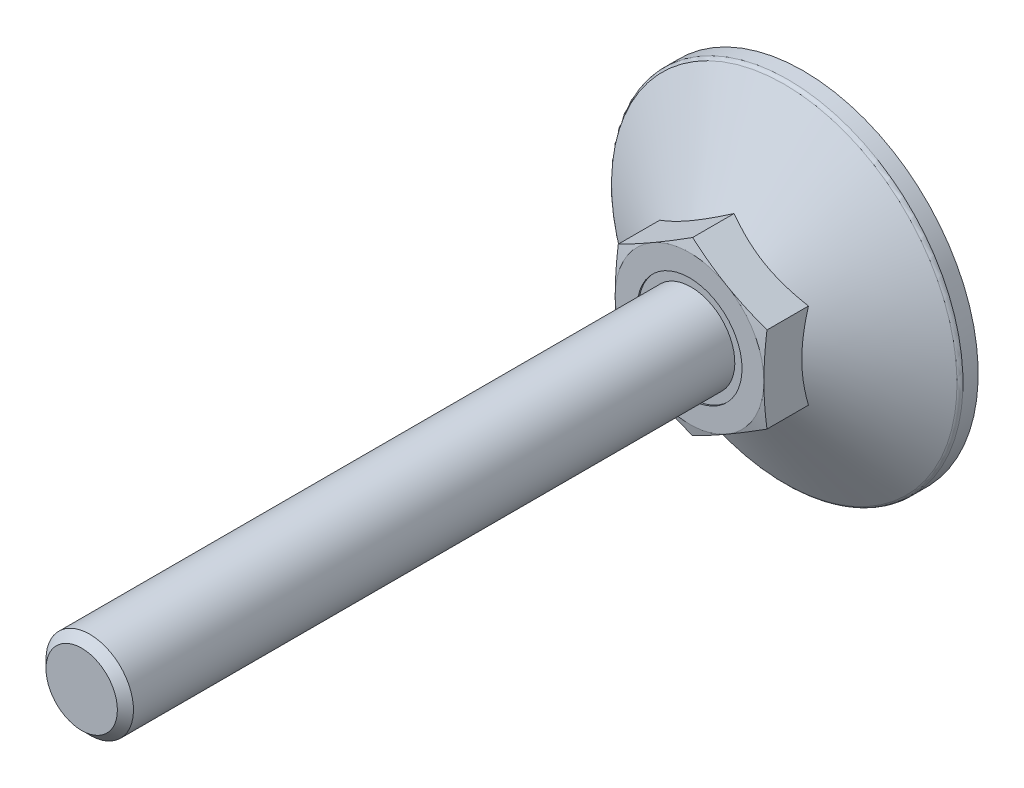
ISO-10303-21;
HEADER;
FILE_DESCRIPTION(('STEP AP214'),'2;1');
FILE_NAME('part.step','',(''),(''),'','','');
FILE_SCHEMA(('AUTOMOTIVE_DESIGN { 1 0 10303 214 1 1 1 1 }'));
ENDSEC;
DATA;
#1=APPLICATION_CONTEXT('core data for automotive mechanical design processes');
#2=APPLICATION_PROTOCOL_DEFINITION('international standard','automotive_design',2000,#1);
#3=PRODUCT_CONTEXT('',#1,'mechanical');
#4=PRODUCT('Part','Part','',(#3));
#5=PRODUCT_RELATED_PRODUCT_CATEGORY('part','',(#4));
#6=PRODUCT_DEFINITION_FORMATION('','',#4);
#7=PRODUCT_DEFINITION_CONTEXT('part definition',#1,'design');
#8=PRODUCT_DEFINITION('design','',#6,#7);
#9=PRODUCT_DEFINITION_SHAPE('','',#8);
#10=(LENGTH_UNIT() NAMED_UNIT(*) SI_UNIT(.MILLI.,.METRE.));
#11=(NAMED_UNIT(*) PLANE_ANGLE_UNIT() SI_UNIT($,.RADIAN.));
#12=(NAMED_UNIT(*) SI_UNIT($,.STERADIAN.) SOLID_ANGLE_UNIT());
#13=UNCERTAINTY_MEASURE_WITH_UNIT(LENGTH_MEASURE(1.E-05),#10,'distance_accuracy_value','');
#14=(GEOMETRIC_REPRESENTATION_CONTEXT(3) GLOBAL_UNCERTAINTY_ASSIGNED_CONTEXT((#13)) GLOBAL_UNIT_ASSIGNED_CONTEXT((#10,
#11,#12)) REPRESENTATION_CONTEXT('',''));
#15=CARTESIAN_POINT('',(0.,0.,0.));
#16=DIRECTION('',(0.,0.,1.));
#17=DIRECTION('',(1.,0.,0.));
#18=AXIS2_PLACEMENT_3D('',#15,#16,#17);
#19=CARTESIAN_POINT('',(0.,9.8149545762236,27.));
#20=DIRECTION('',(0.5,-0.86602540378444,0.));
#21=DIRECTION('',(0.86602540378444,0.5,0.));
#22=AXIS2_PLACEMENT_3D('',#19,#20,#21);
#23=PLANE('',#22);
#24=CARTESIAN_POINT('',(0.000200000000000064,9.81507004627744,12.6476280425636));
#25=CARTESIAN_POINT('',(-0.352800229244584,9.61126526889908,12.7022599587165));
#26=CARTESIAN_POINT('',(-0.706440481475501,9.40709097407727,12.7518566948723));
#27=CARTESIAN_POINT('',(-1.41496987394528,8.99802133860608,12.8389934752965));
#28=CARTESIAN_POINT('',(-1.76985946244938,8.79312573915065,12.8765286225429));
#29=CARTESIAN_POINT('',(-2.47873586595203,8.38385575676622,12.9373509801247));
#30=CARTESIAN_POINT('',(-2.83271788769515,8.17948414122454,12.9607107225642));
#31=CARTESIAN_POINT('',(-3.5411333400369,7.77048028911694,12.9920337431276));
#32=CARTESIAN_POINT('',(-3.89556667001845,7.56584811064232,13.));
#33=CARTESIAN_POINT('',(-4.60443332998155,7.15658375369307,13.));
#34=CARTESIAN_POINT('',(-4.9588666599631,6.95195157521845,12.9920337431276));
#35=CARTESIAN_POINT('',(-5.66728211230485,6.54294772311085,12.9607107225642));
#36=CARTESIAN_POINT('',(-6.02126413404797,6.33857610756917,12.9373509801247));
#37=CARTESIAN_POINT('',(-6.73014053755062,5.92930612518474,12.8765286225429));
#38=CARTESIAN_POINT('',(-7.08503012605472,5.7244105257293,12.8389934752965));
#39=CARTESIAN_POINT('',(-7.7935595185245,5.31534089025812,12.7518566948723));
#40=CARTESIAN_POINT('',(-8.14719977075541,5.11116659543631,12.7022599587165));
#41=CARTESIAN_POINT('',(-8.5002,4.90736181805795,12.6476280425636));
#42=B_SPLINE_CURVE_WITH_KNOTS('',3,(#24,#25,#26,#27,#28,#29,#30,#31,#32,#33,#34,#35,#36,#37,#38,
#39,#40,#41),.UNSPECIFIED.,.F.,.F.,(4,2,2,2,2,2,2,2,4),(0.,1.23382789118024,2.46815608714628,
3.69611406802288,4.92383440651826,6.15155474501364,7.37951272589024,8.61384092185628,
9.84766881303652),.UNSPECIFIED.);
#43=CARTESIAN_POINT('',(0.,9.8149545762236,12.6476589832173));
#44=VERTEX_POINT('',#43);
#45=CARTESIAN_POINT('',(-4.25,7.36121593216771,13.));
#46=VERTEX_POINT('',#45);
#47=EDGE_CURVE('E269',#44,#46,#42,.T.);
#48=ORIENTED_EDGE('',*,*,#47,.F.);
#49=DIRECTION('',(0.,0.,-1.));
#50=VECTOR('',#49,1.);
#51=CARTESIAN_POINT('',(0.,9.8149545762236,27.));
#52=LINE('',#51,#50);
#53=CARTESIAN_POINT('',(0.,9.8149545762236,7.90533871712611));
#54=VERTEX_POINT('',#53);
#55=EDGE_CURVE('E43',#44,#54,#52,.T.);
#56=ORIENTED_EDGE('',*,*,#55,.T.);
#57=CARTESIAN_POINT('',(-8.5002,4.90736181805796,7.90527204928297));
#58=CARTESIAN_POINT('',(-8.31336077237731,5.0152334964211,7.96754195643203));
#59=CARTESIAN_POINT('',(-8.1258249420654,5.12350735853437,8.02698579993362));
#60=CARTESIAN_POINT('',(-7.74923024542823,5.34093440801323,8.13944298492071));
#61=CARTESIAN_POINT('',(-7.56017075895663,5.45008795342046,8.19245355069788));
#62=CARTESIAN_POINT('',(-6.98996524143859,5.77929626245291,8.34079470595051));
#63=CARTESIAN_POINT('',(-6.60656835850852,6.00065055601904,8.42516916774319));
#64=CARTESIAN_POINT('',(-6.03282233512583,6.33190297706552,8.52410807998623));
#65=CARTESIAN_POINT('',(-5.8441872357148,6.44081150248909,8.55229289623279));
#66=CARTESIAN_POINT('',(-5.46606397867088,6.65912106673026,8.59955401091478));
#67=CARTESIAN_POINT('',(-5.27657589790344,6.76852206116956,8.61863111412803));
#68=CARTESIAN_POINT('',(-4.89727347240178,6.98751241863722,8.64719332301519));
#69=CARTESIAN_POINT('',(-4.70745974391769,7.0971014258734,8.65668931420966));
#70=CARTESIAN_POINT('',(-4.3276569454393,7.31638067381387,8.66588571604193));
#71=CARTESIAN_POINT('',(-4.13766788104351,7.42607091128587,8.66558642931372));
#72=CARTESIAN_POINT('',(-3.78247698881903,7.63114046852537,8.65587362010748));
#73=CARTESIAN_POINT('',(-3.61725009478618,7.7265342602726,8.64764492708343));
#74=CARTESIAN_POINT('',(-3.28718328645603,7.91709842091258,8.62393885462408));
#75=CARTESIAN_POINT('',(-3.12234339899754,8.01226877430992,8.60846098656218));
#76=CARTESIAN_POINT('',(-2.62846189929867,8.29741139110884,8.55151947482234));
#77=CARTESIAN_POINT('',(-2.30029449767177,8.48687892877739,8.49955503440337));
#78=CARTESIAN_POINT('',(-1.64047857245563,8.86782383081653,8.36964315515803));
#79=CARTESIAN_POINT('',(-1.30891425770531,9.0592525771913,8.29114502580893));
#80=CARTESIAN_POINT('',(-0.650730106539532,9.43925537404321,8.11298675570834));
#81=CARTESIAN_POINT('',(-0.324101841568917,9.62783429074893,8.01336845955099));
#82=CARTESIAN_POINT('',(0.000199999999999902,9.81507004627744,7.90527204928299));
#83=B_SPLINE_CURVE_WITH_KNOTS('',3,(#57,#58,#59,#60,#61,#62,#63,#64,#65,#66,#67,#68,#69,#70,#71,
#72,#73,#74,#75,#76,#77,#78,#79,#80,#81,#82),.UNSPECIFIED.,.F.,.F.,(4,2,2,2,2,2,2,2,2,2,2,2,4),
(0.,0.673596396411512,1.34748239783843,2.69805431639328,3.35679995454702,4.01548737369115,
4.67342558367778,5.33134346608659,5.90409556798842,6.47688628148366,7.62328361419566,
8.79510569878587,9.96462743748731),.UNSPECIFIED.);
#84=CARTESIAN_POINT('',(-8.5,4.9074772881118,7.90533871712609));
#85=VERTEX_POINT('',#84);
#86=EDGE_CURVE('E237',#85,#54,#83,.T.);
#87=ORIENTED_EDGE('',*,*,#86,.F.);
#88=DIRECTION('',(0.,0.,-1.));
#89=VECTOR('',#88,1.);
#90=CARTESIAN_POINT('',(-8.5,4.9074772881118,27.));
#91=LINE('',#90,#89);
#92=CARTESIAN_POINT('',(-8.5,4.9074772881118,12.6476589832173));
#93=VERTEX_POINT('',#92);
#94=EDGE_CURVE('E282',#93,#85,#91,.T.);
#95=ORIENTED_EDGE('',*,*,#94,.F.);
#96=EDGE_CURVE('E169',#46,#93,#42,.T.);
#97=ORIENTED_EDGE('',*,*,#96,.F.);
#98=EDGE_LOOP('',(#48,#56,#87,#95,#97));
#99=FACE_BOUND('',#98,.T.);
#100=ADVANCED_FACE('F14',(#99),#23,.F.);
#101=CARTESIAN_POINT('',(8.5,4.9074772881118,27.));
#102=DIRECTION('',(-0.5,-0.86602540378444,0.));
#103=DIRECTION('',(0.86602540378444,-0.5,0.));
#104=AXIS2_PLACEMENT_3D('',#101,#102,#103);
#105=PLANE('',#104);
#106=CARTESIAN_POINT('',(8.5002,4.90736181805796,12.6476280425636));
#107=CARTESIAN_POINT('',(8.14719977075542,5.11116659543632,12.7022599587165));
#108=CARTESIAN_POINT('',(7.7935595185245,5.31534089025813,12.7518566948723));
#109=CARTESIAN_POINT('',(7.08503012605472,5.72441052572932,12.8389934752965));
#110=CARTESIAN_POINT('',(6.73014053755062,5.92930612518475,12.8765286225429));
#111=CARTESIAN_POINT('',(6.02126413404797,6.33857610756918,12.9373509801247));
#112=CARTESIAN_POINT('',(5.66728211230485,6.54294772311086,12.9607107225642));
#113=CARTESIAN_POINT('',(4.9588666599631,6.95195157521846,12.9920337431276));
#114=CARTESIAN_POINT('',(4.60443332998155,7.15658375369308,13.));
#115=CARTESIAN_POINT('',(3.89556667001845,7.56584811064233,13.));
#116=CARTESIAN_POINT('',(3.5411333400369,7.77048028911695,12.9920337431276));
#117=CARTESIAN_POINT('',(2.83271788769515,8.17948414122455,12.9607107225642));
#118=CARTESIAN_POINT('',(2.47873586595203,8.38385575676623,12.9373509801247));
#119=CARTESIAN_POINT('',(1.76985946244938,8.79312573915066,12.8765286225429));
#120=CARTESIAN_POINT('',(1.41496987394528,8.9980213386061,12.8389934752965));
#121=CARTESIAN_POINT('',(0.706440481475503,9.40709097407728,12.7518566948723));
#122=CARTESIAN_POINT('',(0.352800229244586,9.61126526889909,12.7022599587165));
#123=CARTESIAN_POINT('',(-0.000200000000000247,9.81507004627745,12.6476280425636));
#124=B_SPLINE_CURVE_WITH_KNOTS('',3,(#106,#107,#108,#109,#110,#111,#112,#113,#114,#115,#116,
#117,#118,#119,#120,#121,#122,#123),.UNSPECIFIED.,.F.,.F.,(4,2,2,2,2,2,2,2,4),(0.,
1.23382789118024,2.46815608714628,3.69611406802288,4.92383440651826,6.15155474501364,
7.37951272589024,8.61384092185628,9.84766881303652),.UNSPECIFIED.);
#125=CARTESIAN_POINT('',(8.5,4.9074772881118,12.6476589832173));
#126=VERTEX_POINT('',#125);
#127=CARTESIAN_POINT('',(4.25,7.36121593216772,13.));
#128=VERTEX_POINT('',#127);
#129=EDGE_CURVE('E121',#126,#128,#124,.T.);
#130=ORIENTED_EDGE('',*,*,#129,.F.);
#131=DIRECTION('',(0.,0.,-1.));
#132=VECTOR('',#131,1.);
#133=CARTESIAN_POINT('',(8.5,4.9074772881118,27.));
#134=LINE('',#133,#132);
#135=CARTESIAN_POINT('',(8.5,4.9074772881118,7.90533871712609));
#136=VERTEX_POINT('',#135);
#137=EDGE_CURVE('E128',#126,#136,#134,.T.);
#138=ORIENTED_EDGE('',*,*,#137,.T.);
#139=CARTESIAN_POINT('',(-0.0002,9.81507004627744,7.90527204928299));
#140=CARTESIAN_POINT('',(0.186639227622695,9.7071983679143,7.96754195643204));
#141=CARTESIAN_POINT('',(0.374175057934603,9.59892450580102,8.02698579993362));
#142=CARTESIAN_POINT('',(0.750769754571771,9.38149745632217,8.13944298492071));
#143=CARTESIAN_POINT('',(0.939829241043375,9.27234391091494,8.19245355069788));
#144=CARTESIAN_POINT('',(1.51003475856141,8.94313560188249,8.34079470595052));
#145=CARTESIAN_POINT('',(1.89343164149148,8.72178130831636,8.42516916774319));
#146=CARTESIAN_POINT('',(2.46717766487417,8.39052888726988,8.52410807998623));
#147=CARTESIAN_POINT('',(2.6558127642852,8.28162036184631,8.55229289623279));
#148=CARTESIAN_POINT('',(3.03393602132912,8.06331079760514,8.59955401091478));
#149=CARTESIAN_POINT('',(3.22342410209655,7.95390980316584,8.61863111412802));
#150=CARTESIAN_POINT('',(3.60272652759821,7.73491944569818,8.64719332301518));
#151=CARTESIAN_POINT('',(3.79254025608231,7.62533043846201,8.65668931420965));
#152=CARTESIAN_POINT('',(4.1723430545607,7.40605119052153,8.66588571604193));
#153=CARTESIAN_POINT('',(4.36233211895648,7.29636095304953,8.66558642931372));
#154=CARTESIAN_POINT('',(4.71752301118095,7.09129139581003,8.65587362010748));
#155=CARTESIAN_POINT('',(4.88274990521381,6.9958976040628,8.64764492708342));
#156=CARTESIAN_POINT('',(5.21281671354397,6.80533344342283,8.62393885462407));
#157=CARTESIAN_POINT('',(5.37765660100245,6.71016309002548,8.60846098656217));
#158=CARTESIAN_POINT('',(5.87153810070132,6.42502047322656,8.55151947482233));
#159=CARTESIAN_POINT('',(6.19970550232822,6.23555293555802,8.49955503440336));
#160=CARTESIAN_POINT('',(6.85952142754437,5.85460803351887,8.36964315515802));
#161=CARTESIAN_POINT('',(7.19108574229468,5.6631792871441,8.29114502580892));
#162=CARTESIAN_POINT('',(7.84926989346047,5.28317649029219,8.11298675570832));
#163=CARTESIAN_POINT('',(8.17589815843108,5.09459757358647,8.01336845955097));
#164=CARTESIAN_POINT('',(8.5002,4.90736181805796,7.90527204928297));
#165=B_SPLINE_CURVE_WITH_KNOTS('',3,(#139,#140,#141,#142,#143,#144,#145,#146,#147,#148,#149,
#150,#151,#152,#153,#154,#155,#156,#157,#158,#159,#160,#161,#162,#163,#164),.UNSPECIFIED.,.F.,
.F.,(4,2,2,2,2,2,2,2,2,2,2,2,4),(0.,0.673596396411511,1.34748239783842,2.69805431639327,
3.35679995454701,4.01548737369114,4.67342558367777,5.33134346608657,5.90409556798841,
6.47688628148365,7.62328361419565,8.79510569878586,9.96462743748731),.UNSPECIFIED.);
#166=EDGE_CURVE('E231',#54,#136,#165,.T.);
#167=ORIENTED_EDGE('',*,*,#166,.F.);
#168=ORIENTED_EDGE('',*,*,#55,.F.);
#169=EDGE_CURVE('E138',#128,#44,#124,.T.);
#170=ORIENTED_EDGE('',*,*,#169,.F.);
#171=EDGE_LOOP('',(#130,#138,#167,#168,#170));
#172=FACE_BOUND('',#171,.T.);
#173=ADVANCED_FACE('F243',(#172),#105,.F.);
#174=CARTESIAN_POINT('',(8.5,-4.9074772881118,27.));
#175=DIRECTION('',(-1.,0.,0.));
#176=DIRECTION('',(0.,-1.,0.));
#177=AXIS2_PLACEMENT_3D('',#174,#175,#176);
#178=PLANE('',#177);
#179=CARTESIAN_POINT('',(8.5,-12.9889345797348,11.1182023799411));
#180=CARTESIAN_POINT('',(8.5,-12.6032360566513,11.2046559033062));
#181=CARTESIAN_POINT('',(8.5,-12.21729648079,11.2900532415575));
#182=CARTESIAN_POINT('',(8.5,-11.4448168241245,11.4581654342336));
#183=CARTESIAN_POINT('',(8.5,-11.0582767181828,11.5408801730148));
#184=CARTESIAN_POINT('',(8.5,-10.2841322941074,11.7031288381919));
#185=CARTESIAN_POINT('',(8.5,-9.89652730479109,11.7826595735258));
#186=CARTESIAN_POINT('',(8.5,-9.12051106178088,11.9376828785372));
#187=CARTESIAN_POINT('',(8.5,-8.73209981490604,12.0131754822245));
#188=CARTESIAN_POINT('',(8.5,-7.95742675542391,12.158579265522));
#189=CARTESIAN_POINT('',(8.5,-7.57117241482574,12.2285300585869));
#190=CARTESIAN_POINT('',(8.5,-6.79761052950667,12.3623321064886));
#191=CARTESIAN_POINT('',(8.5,-6.41030300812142,12.4261834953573));
#192=CARTESIAN_POINT('',(8.5,-5.63455876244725,12.5463505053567));
#193=CARTESIAN_POINT('',(8.5,-5.24612218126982,12.6026670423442));
#194=CARTESIAN_POINT('',(8.5,-4.46801271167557,12.7061060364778));
#195=CARTESIAN_POINT('',(8.5,-4.07833982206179,12.7532284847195));
#196=CARTESIAN_POINT('',(8.5,-3.29335868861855,12.8369464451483));
#197=CARTESIAN_POINT('',(8.5,-2.89803680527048,12.8734159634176));
#198=CARTESIAN_POINT('',(8.5,-2.10639771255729,12.9333131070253));
#199=CARTESIAN_POINT('',(8.5,-1.71008052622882,12.956741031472));
#200=CARTESIAN_POINT('',(8.5,-0.9170259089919,12.9891886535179));
#201=CARTESIAN_POINT('',(8.5,-0.520288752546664,12.9982149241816));
#202=CARTESIAN_POINT('',(8.5,0.273244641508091,13.0013041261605));
#203=CARTESIAN_POINT('',(8.5,0.67004087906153,12.9953670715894));
#204=CARTESIAN_POINT('',(8.5,1.46457883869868,12.9688634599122));
#205=CARTESIAN_POINT('',(8.5,1.86231875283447,12.9482437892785));
#206=CARTESIAN_POINT('',(8.5,2.65686409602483,12.8935525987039));
#207=CARTESIAN_POINT('',(8.5,3.05366950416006,12.8594807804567));
#208=CARTESIAN_POINT('',(8.5,3.84634231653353,12.779608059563));
#209=CARTESIAN_POINT('',(8.5,4.2422089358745,12.7337994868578));
#210=CARTESIAN_POINT('',(8.5,5.03266791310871,12.6323615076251));
#211=CARTESIAN_POINT('',(8.5,5.42726026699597,12.5767320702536));
#212=CARTESIAN_POINT('',(8.5,6.1895493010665,12.4613191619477));
#213=CARTESIAN_POINT('',(8.5,6.55732348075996,12.4020423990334));
#214=CARTESIAN_POINT('',(8.5,7.29190114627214,12.2777249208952));
#215=CARTESIAN_POINT('',(8.5,7.65870460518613,12.2126840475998));
#216=CARTESIAN_POINT('',(8.5,8.3914750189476,12.0778925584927));
#217=CARTESIAN_POINT('',(8.5,8.75744189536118,12.0081415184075));
#218=CARTESIAN_POINT('',(8.5,9.48862448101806,11.8647967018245));
#219=CARTESIAN_POINT('',(8.5,9.8538401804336,11.7912028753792));
#220=CARTESIAN_POINT('',(8.5,10.583704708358,11.6408517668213));
#221=CARTESIAN_POINT('',(8.5,10.9483533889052,11.5640937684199));
#222=CARTESIAN_POINT('',(8.5,11.6770953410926,11.4079812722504));
#223=CARTESIAN_POINT('',(8.5,12.0411886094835,11.3286267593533));
#224=CARTESIAN_POINT('',(8.5,13.1327103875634,11.0873699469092));
#225=CARTESIAN_POINT('',(8.5,13.8594305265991,10.9222640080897));
#226=CARTESIAN_POINT('',(8.5,15.3043455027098,10.5877480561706));
#227=CARTESIAN_POINT('',(8.5,16.0225539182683,10.4183963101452));
#228=CARTESIAN_POINT('',(8.5,17.4579695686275,10.0754513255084));
#229=CARTESIAN_POINT('',(8.5,18.1751767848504,9.90185800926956));
#230=CARTESIAN_POINT('',(8.5,19.6079369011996,9.55175911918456));
#231=CARTESIAN_POINT('',(8.5,20.3234907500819,9.37525741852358));
#232=CARTESIAN_POINT('',(8.5,21.7539755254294,9.01984625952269));
#233=CARTESIAN_POINT('',(8.5,22.46890647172,8.84093688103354));
#234=CARTESIAN_POINT('',(8.5,23.183620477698,8.66117463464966));
#235=B_SPLINE_CURVE_WITH_KNOTS('',3,(#179,#180,#181,#182,#183,#184,#185,#186,#187,#188,#189,
#190,#191,#192,#193,#194,#195,#196,#197,#198,#199,#200,#201,#202,#203,#204,#205,#206,#207,#208,
#209,#210,#211,#212,#213,#214,#215,#216,#217,#218,#219,#220,#221,#222,#223,#224,#225,#226,#227,
#228,#229,#230,#231,#232,#233,#234),.UNSPECIFIED.,.F.,.F.,(4,2,2,2,2,2,2,2,2,2,2,2,2,2,2,2,2,2,
2,2,2,2,2,2,2,2,2,4),(0.,1.18581174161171,2.37167453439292,3.55869749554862,4.74571045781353,
5.92328329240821,7.10083024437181,8.27823393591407,9.45563876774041,10.6464520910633,
11.8372381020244,13.0274804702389,14.2177217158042,15.4122906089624,16.6068859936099,
17.8022640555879,18.9976458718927,20.1151535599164,21.2326919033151,22.3503310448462,
23.4679847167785,24.5858928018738,25.7038074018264,27.9394844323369,30.1531835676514,
32.3669232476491,34.5779211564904,36.7888459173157),.UNSPECIFIED.);
#236=CARTESIAN_POINT('',(8.5,-4.90747728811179,12.6476589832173));
#237=VERTEX_POINT('',#236);
#238=CARTESIAN_POINT('',(8.5,0.,13.));
#239=VERTEX_POINT('',#238);
#240=EDGE_CURVE('E95',#237,#239,#235,.T.);
#241=ORIENTED_EDGE('',*,*,#240,.F.);
#242=DIRECTION('',(0.,0.,-1.));
#243=VECTOR('',#242,1.);
#244=CARTESIAN_POINT('',(8.5,-4.9074772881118,27.));
#245=LINE('',#244,#243);
#246=CARTESIAN_POINT('',(8.5,-4.9074772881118,7.90533871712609));
#247=VERTEX_POINT('',#246);
#248=EDGE_CURVE('E275',#237,#247,#245,.T.);
#249=ORIENTED_EDGE('',*,*,#248,.T.);
#250=CARTESIAN_POINT('',(8.5,12.7492767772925,4.72527230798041));
#251=CARTESIAN_POINT('',(8.5,12.3811478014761,4.90206026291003));
#252=CARTESIAN_POINT('',(8.5,12.0121249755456,5.07702151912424));
#253=CARTESIAN_POINT('',(8.5,11.2718137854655,5.42225230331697));
#254=CARTESIAN_POINT('',(8.5,10.9005250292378,5.59252098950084));
#255=CARTESIAN_POINT('',(8.5,10.1530767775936,5.92827896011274));
#256=CARTESIAN_POINT('',(8.5,9.77690140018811,6.09373302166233));
#257=CARTESIAN_POINT('',(8.5,9.02139912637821,6.41725455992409));
#258=CARTESIAN_POINT('',(8.5,8.64207239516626,6.57532242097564));
#259=CARTESIAN_POINT('',(8.5,7.86979942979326,6.88607334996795));
#260=CARTESIAN_POINT('',(8.5,7.47675434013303,7.03851219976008));
#261=CARTESIAN_POINT('',(8.5,6.68591204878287,7.33076935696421));
#262=CARTESIAN_POINT('',(8.5,6.28811429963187,7.47058619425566));
#263=CARTESIAN_POINT('',(8.5,5.48802263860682,7.733611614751));
#264=CARTESIAN_POINT('',(8.5,5.08574124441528,7.85685783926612));
#265=CARTESIAN_POINT('',(8.5,4.27544970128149,8.08251258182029));
#266=CARTESIAN_POINT('',(8.5,3.86744153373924,8.18492812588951));
#267=CARTESIAN_POINT('',(8.5,3.04728386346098,8.36327495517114));
#268=CARTESIAN_POINT('',(8.5,2.6351585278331,8.43931422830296));
#269=CARTESIAN_POINT('',(8.5,2.01359122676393,8.53003978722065));
#270=CARTESIAN_POINT('',(8.5,1.80582110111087,8.55639399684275));
#271=CARTESIAN_POINT('',(8.5,1.38940213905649,8.60080126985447));
#272=CARTESIAN_POINT('',(8.5,1.18075338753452,8.61885511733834));
#273=CARTESIAN_POINT('',(8.5,0.765376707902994,8.64609671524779));
#274=CARTESIAN_POINT('',(8.5,0.558655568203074,8.65538769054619));
#275=CARTESIAN_POINT('',(8.5,0.1450067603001,8.66526416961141));
#276=CARTESIAN_POINT('',(8.5,-0.0619209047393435,8.6658498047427));
#277=CARTESIAN_POINT('',(8.5,-0.475626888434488,8.65830085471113));
#278=CARTESIAN_POINT('',(8.5,-0.682405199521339,8.65016585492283));
#279=CARTESIAN_POINT('',(8.5,-1.09545270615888,8.625363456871));
#280=CARTESIAN_POINT('',(8.5,-1.30172187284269,8.60869558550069));
#281=CARTESIAN_POINT('',(8.5,-1.81090940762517,8.55735076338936));
#282=CARTESIAN_POINT('',(8.5,-2.11335210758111,8.51788364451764));
#283=CARTESIAN_POINT('',(8.5,-2.71570235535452,8.4228634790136));
#284=CARTESIAN_POINT('',(8.5,-3.01560949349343,8.36730788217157));
#285=CARTESIAN_POINT('',(8.5,-3.61268959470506,8.2420877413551));
#286=CARTESIAN_POINT('',(8.5,-3.90986014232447,8.17241178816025));
#287=CARTESIAN_POINT('',(8.5,-4.50108875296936,8.02104250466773));
#288=CARTESIAN_POINT('',(8.5,-4.79514688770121,7.93934945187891));
#289=CARTESIAN_POINT('',(8.5,-5.3871494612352,7.7638116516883));
#290=CARTESIAN_POINT('',(8.5,-5.68502188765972,7.6697256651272));
#291=CARTESIAN_POINT('',(8.5,-6.27782977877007,7.4727599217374));
#292=CARTESIAN_POINT('',(8.5,-6.57276522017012,7.36988009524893));
#293=CARTESIAN_POINT('',(8.5,-7.15987047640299,7.15687683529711));
#294=CARTESIAN_POINT('',(8.5,-7.45204129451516,7.04675615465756));
#295=CARTESIAN_POINT('',(8.5,-8.03401937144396,6.82048197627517));
#296=CARTESIAN_POINT('',(8.5,-8.32382669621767,6.70432864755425));
#297=CARTESIAN_POINT('',(8.5,-8.8985343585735,6.468166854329));
#298=CARTESIAN_POINT('',(8.5,-9.18345493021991,6.34820749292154));
#299=CARTESIAN_POINT('',(8.5,-9.75152375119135,6.10415692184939));
#300=CARTESIAN_POINT('',(8.5,-10.034671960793,5.98006561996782));
#301=CARTESIAN_POINT('',(8.5,-10.8818575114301,5.60257794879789));
#302=CARTESIAN_POINT('',(8.5,-11.4435817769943,5.34399030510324));
#303=CARTESIAN_POINT('',(8.5,-12.5625477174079,4.81675169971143));
#304=CARTESIAN_POINT('',(8.5,-13.1197873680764,4.54809647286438));
#305=CARTESIAN_POINT('',(8.5,-14.2306052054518,4.00340707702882));
#306=CARTESIAN_POINT('',(8.5,-14.7841835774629,3.72737328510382));
#307=CARTESIAN_POINT('',(8.5,-15.8894273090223,3.16924748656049));
#308=CARTESIAN_POINT('',(8.5,-16.4410879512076,2.88714616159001));
#309=CARTESIAN_POINT('',(8.5,-17.5421722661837,2.31860293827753));
#310=CARTESIAN_POINT('',(8.5,-18.0915959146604,2.03216099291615));
#311=CARTESIAN_POINT('',(8.5,-19.1885131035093,1.45593769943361));
#312=CARTESIAN_POINT('',(8.5,-19.7360070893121,1.1661571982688));
#313=CARTESIAN_POINT('',(8.5,-20.8295421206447,0.583866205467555));
#314=CARTESIAN_POINT('',(8.5,-21.3755831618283,0.291355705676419));
#315=CARTESIAN_POINT('',(8.5,-22.8810608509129,-0.519031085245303));
#316=CARTESIAN_POINT('',(8.5,-23.8392547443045,-1.03921546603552));
#317=CARTESIAN_POINT('',(8.5,-25.7530641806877,-2.08445783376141));
#318=CARTESIAN_POINT('',(8.5,-26.708679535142,-2.60951616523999));
#319=CARTESIAN_POINT('',(8.5,-28.6148788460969,-3.66152013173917));
#320=CARTESIAN_POINT('',(8.5,-29.565469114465,-4.18845433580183));
#321=CARTESIAN_POINT('',(8.5,-30.9901906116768,-4.98085413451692));
#322=CARTESIAN_POINT('',(8.5,-31.4648842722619,-5.24530955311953));
#323=CARTESIAN_POINT('',(8.5,-32.4139385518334,-5.77481644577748));
#324=CARTESIAN_POINT('',(8.5,-32.8882991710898,-6.03986791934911));
#325=CARTESIAN_POINT('',(8.5,-33.3625145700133,-6.30517901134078));
#326=B_SPLINE_CURVE_WITH_KNOTS('',3,(#250,#251,#252,#253,#254,#255,#256,#257,#258,#259,#260,
#261,#262,#263,#264,#265,#266,#267,#268,#269,#270,#271,#272,#273,#274,#275,#276,#277,#278,#279,
#280,#281,#282,#283,#284,#285,#286,#287,#288,#289,#290,#291,#292,#293,#294,#295,#296,#297,#298,
#299,#300,#301,#302,#303,#304,#305,#306,#307,#308,#309,#310,#311,#312,#313,#314,#315,#316,#317,
#318,#319,#320,#321,#322,#323,#324,#325),.UNSPECIFIED.,.F.,.F.,(4,2,2,2,2,2,2,2,2,2,2,2,2,2,2,2,
2,2,2,2,2,2,2,2,2,2,2,2,2,2,2,2,2,2,2,2,2,4),(0.,1.22515253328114,2.45052343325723,
3.6833213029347,4.91605495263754,6.18059988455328,7.44529191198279,8.70706073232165,
9.96840325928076,11.2245189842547,11.852683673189,12.4807890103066,13.1013994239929,
13.7220004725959,14.3426310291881,14.9632960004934,15.8778021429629,16.7924533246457,
17.7078465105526,18.6232185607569,19.5601888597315,20.4971665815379,21.433790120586,
22.3703874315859,23.297780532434,24.225194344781,26.0801973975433,27.9359954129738,
29.7916987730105,31.6504906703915,33.5093027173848,35.3676531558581,37.2260091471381,
40.4968499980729,43.7679238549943,47.0285209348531,48.6586852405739,50.2888482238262),.UNSPECIFIED.);
#327=EDGE_CURVE('E197',#136,#247,#326,.T.);
#328=ORIENTED_EDGE('',*,*,#327,.F.);
#329=ORIENTED_EDGE('',*,*,#137,.F.);
#330=EDGE_CURVE('E106',#239,#126,#235,.T.);
#331=ORIENTED_EDGE('',*,*,#330,.F.);
#332=EDGE_LOOP('',(#241,#249,#328,#329,#331));
#333=FACE_BOUND('',#332,.T.);
#334=ADVANCED_FACE('F126',(#333),#178,.F.);
#335=CARTESIAN_POINT('',(0.,-9.8149545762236,27.));
#336=DIRECTION('',(-0.5,0.86602540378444,0.));
#337=DIRECTION('',(-0.86602540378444,-0.5,0.));
#338=AXIS2_PLACEMENT_3D('',#335,#336,#337);
#339=PLANE('',#338);
#340=CARTESIAN_POINT('',(-0.000200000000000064,-9.81507004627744,12.6476280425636));
#341=CARTESIAN_POINT('',(0.352800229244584,-9.61126526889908,12.7022599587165));
#342=CARTESIAN_POINT('',(0.706440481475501,-9.40709097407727,12.7518566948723));
#343=CARTESIAN_POINT('',(1.41496987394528,-8.99802133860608,12.8389934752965));
#344=CARTESIAN_POINT('',(1.76985946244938,-8.79312573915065,12.8765286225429));
#345=CARTESIAN_POINT('',(2.47873586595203,-8.38385575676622,12.9373509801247));
#346=CARTESIAN_POINT('',(2.83271788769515,-8.17948414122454,12.9607107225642));
#347=CARTESIAN_POINT('',(3.5411333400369,-7.77048028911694,12.9920337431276));
#348=CARTESIAN_POINT('',(3.89556667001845,-7.56584811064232,13.));
#349=CARTESIAN_POINT('',(4.60443332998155,-7.15658375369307,13.));
#350=CARTESIAN_POINT('',(4.9588666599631,-6.95195157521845,12.9920337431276));
#351=CARTESIAN_POINT('',(5.66728211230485,-6.54294772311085,12.9607107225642));
#352=CARTESIAN_POINT('',(6.02126413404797,-6.33857610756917,12.9373509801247));
#353=CARTESIAN_POINT('',(6.73014053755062,-5.92930612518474,12.8765286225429));
#354=CARTESIAN_POINT('',(7.08503012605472,-5.7244105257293,12.8389934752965));
#355=CARTESIAN_POINT('',(7.7935595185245,-5.31534089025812,12.7518566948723));
#356=CARTESIAN_POINT('',(8.14719977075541,-5.11116659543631,12.7022599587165));
#357=CARTESIAN_POINT('',(8.5002,-4.90736181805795,12.6476280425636));
#358=B_SPLINE_CURVE_WITH_KNOTS('',3,(#340,#341,#342,#343,#344,#345,#346,#347,#348,#349,#350,
#351,#352,#353,#354,#355,#356,#357),.UNSPECIFIED.,.F.,.F.,(4,2,2,2,2,2,2,2,4),(0.,
1.23382789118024,2.46815608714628,3.69611406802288,4.92383440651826,6.15155474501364,
7.37951272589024,8.61384092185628,9.84766881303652),.UNSPECIFIED.);
#359=CARTESIAN_POINT('',(0.,-9.81495457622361,12.6476589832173));
#360=VERTEX_POINT('',#359);
#361=CARTESIAN_POINT('',(4.25,-7.36121593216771,13.));
#362=VERTEX_POINT('',#361);
#363=EDGE_CURVE('E130',#360,#362,#358,.T.);
#364=ORIENTED_EDGE('',*,*,#363,.F.);
#365=DIRECTION('',(0.,0.,-1.));
#366=VECTOR('',#365,1.);
#367=CARTESIAN_POINT('',(0.,-9.8149545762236,27.));
#368=LINE('',#367,#366);
#369=CARTESIAN_POINT('',(0.,-9.8149545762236,7.90533871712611));
#370=VERTEX_POINT('',#369);
#371=EDGE_CURVE('E279',#360,#370,#368,.T.);
#372=ORIENTED_EDGE('',*,*,#371,.T.);
#373=CARTESIAN_POINT('',(8.5002,-4.90736181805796,7.90527204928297));
#374=CARTESIAN_POINT('',(8.31336077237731,-5.0152334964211,7.96754195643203));
#375=CARTESIAN_POINT('',(8.1258249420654,-5.12350735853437,8.02698579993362));
#376=CARTESIAN_POINT('',(7.74923024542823,-5.34093440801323,8.13944298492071));
#377=CARTESIAN_POINT('',(7.56017075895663,-5.45008795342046,8.19245355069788));
#378=CARTESIAN_POINT('',(6.98996524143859,-5.77929626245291,8.34079470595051));
#379=CARTESIAN_POINT('',(6.60656835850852,-6.00065055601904,8.42516916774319));
#380=CARTESIAN_POINT('',(6.03282233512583,-6.33190297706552,8.52410807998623));
#381=CARTESIAN_POINT('',(5.8441872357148,-6.44081150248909,8.55229289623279));
#382=CARTESIAN_POINT('',(5.46606397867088,-6.65912106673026,8.59955401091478));
#383=CARTESIAN_POINT('',(5.27657589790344,-6.76852206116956,8.61863111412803));
#384=CARTESIAN_POINT('',(4.89727347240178,-6.98751241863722,8.64719332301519));
#385=CARTESIAN_POINT('',(4.70745974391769,-7.0971014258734,8.65668931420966));
#386=CARTESIAN_POINT('',(4.3276569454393,-7.31638067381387,8.66588571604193));
#387=CARTESIAN_POINT('',(4.13766788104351,-7.42607091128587,8.66558642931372));
#388=CARTESIAN_POINT('',(3.78247698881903,-7.63114046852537,8.65587362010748));
#389=CARTESIAN_POINT('',(3.61725009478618,-7.7265342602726,8.64764492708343));
#390=CARTESIAN_POINT('',(3.28718328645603,-7.91709842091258,8.62393885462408));
#391=CARTESIAN_POINT('',(3.12234339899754,-8.01226877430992,8.60846098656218));
#392=CARTESIAN_POINT('',(2.62846189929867,-8.29741139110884,8.55151947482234));
#393=CARTESIAN_POINT('',(2.30029449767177,-8.48687892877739,8.49955503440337));
#394=CARTESIAN_POINT('',(1.64047857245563,-8.86782383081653,8.36964315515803));
#395=CARTESIAN_POINT('',(1.30891425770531,-9.0592525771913,8.29114502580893));
#396=CARTESIAN_POINT('',(0.650730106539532,-9.43925537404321,8.11298675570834));
#397=CARTESIAN_POINT('',(0.324101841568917,-9.62783429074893,8.01336845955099));
#398=CARTESIAN_POINT('',(-0.000199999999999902,-9.81507004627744,7.90527204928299));
#399=B_SPLINE_CURVE_WITH_KNOTS('',3,(#373,#374,#375,#376,#377,#378,#379,#380,#381,#382,#383,
#384,#385,#386,#387,#388,#389,#390,#391,#392,#393,#394,#395,#396,#397,#398),.UNSPECIFIED.,.F.,
.F.,(4,2,2,2,2,2,2,2,2,2,2,2,4),(0.,0.673596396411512,1.34748239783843,2.69805431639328,
3.35679995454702,4.01548737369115,4.67342558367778,5.33134346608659,5.90409556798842,
6.47688628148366,7.62328361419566,8.79510569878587,9.96462743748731),.UNSPECIFIED.);
#400=EDGE_CURVE('E188',#247,#370,#399,.T.);
#401=ORIENTED_EDGE('',*,*,#400,.F.);
#402=ORIENTED_EDGE('',*,*,#248,.F.);
#403=EDGE_CURVE('E101',#362,#237,#358,.T.);
#404=ORIENTED_EDGE('',*,*,#403,.F.);
#405=EDGE_LOOP('',(#364,#372,#401,#402,#404));
#406=FACE_BOUND('',#405,.T.);
#407=ADVANCED_FACE('F180',(#406),#339,.F.);
#408=CARTESIAN_POINT('',(-8.5,-4.9074772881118,27.));
#409=DIRECTION('',(0.5,0.86602540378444,0.));
#410=DIRECTION('',(-0.86602540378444,0.5,0.));
#411=AXIS2_PLACEMENT_3D('',#408,#409,#410);
#412=PLANE('',#411);
#413=CARTESIAN_POINT('',(-8.5002,-4.90736181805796,12.6476280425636));
#414=CARTESIAN_POINT('',(-8.14719977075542,-5.11116659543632,12.7022599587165));
#415=CARTESIAN_POINT('',(-7.7935595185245,-5.31534089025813,12.7518566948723));
#416=CARTESIAN_POINT('',(-7.08503012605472,-5.72441052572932,12.8389934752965));
#417=CARTESIAN_POINT('',(-6.73014053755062,-5.92930612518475,12.8765286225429));
#418=CARTESIAN_POINT('',(-6.02126413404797,-6.33857610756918,12.9373509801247));
#419=CARTESIAN_POINT('',(-5.66728211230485,-6.54294772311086,12.9607107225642));
#420=CARTESIAN_POINT('',(-4.9588666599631,-6.95195157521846,12.9920337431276));
#421=CARTESIAN_POINT('',(-4.60443332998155,-7.15658375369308,13.));
#422=CARTESIAN_POINT('',(-3.89556667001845,-7.56584811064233,13.));
#423=CARTESIAN_POINT('',(-3.5411333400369,-7.77048028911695,12.9920337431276));
#424=CARTESIAN_POINT('',(-2.83271788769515,-8.17948414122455,12.9607107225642));
#425=CARTESIAN_POINT('',(-2.47873586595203,-8.38385575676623,12.9373509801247));
#426=CARTESIAN_POINT('',(-1.76985946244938,-8.79312573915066,12.8765286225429));
#427=CARTESIAN_POINT('',(-1.41496987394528,-8.9980213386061,12.8389934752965));
#428=CARTESIAN_POINT('',(-0.706440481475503,-9.40709097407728,12.7518566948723));
#429=CARTESIAN_POINT('',(-0.352800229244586,-9.61126526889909,12.7022599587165));
#430=CARTESIAN_POINT('',(0.000200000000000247,-9.81507004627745,12.6476280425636));
#431=B_SPLINE_CURVE_WITH_KNOTS('',3,(#413,#414,#415,#416,#417,#418,#419,#420,#421,#422,#423,
#424,#425,#426,#427,#428,#429,#430),.UNSPECIFIED.,.F.,.F.,(4,2,2,2,2,2,2,2,4),(0.,
1.23382789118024,2.46815608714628,3.69611406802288,4.92383440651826,6.15155474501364,
7.37951272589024,8.61384092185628,9.84766881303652),.UNSPECIFIED.);
#432=CARTESIAN_POINT('',(-8.5,-4.9074772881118,12.6476589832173));
#433=VERTEX_POINT('',#432);
#434=CARTESIAN_POINT('',(-4.25,-7.36121593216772,13.));
#435=VERTEX_POINT('',#434);
#436=EDGE_CURVE('E161',#433,#435,#431,.T.);
#437=ORIENTED_EDGE('',*,*,#436,.F.);
#438=DIRECTION('',(0.,0.,-1.));
#439=VECTOR('',#438,1.);
#440=CARTESIAN_POINT('',(-8.5,-4.9074772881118,27.));
#441=LINE('',#440,#439);
#442=CARTESIAN_POINT('',(-8.5,-4.9074772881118,7.90533871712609));
#443=VERTEX_POINT('',#442);
#444=EDGE_CURVE('E281',#433,#443,#441,.T.);
#445=ORIENTED_EDGE('',*,*,#444,.T.);
#446=CARTESIAN_POINT('',(0.0002,-9.81507004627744,7.90527204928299));
#447=CARTESIAN_POINT('',(-0.186639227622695,-9.7071983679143,7.96754195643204));
#448=CARTESIAN_POINT('',(-0.374175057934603,-9.59892450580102,8.02698579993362));
#449=CARTESIAN_POINT('',(-0.750769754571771,-9.38149745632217,8.13944298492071));
#450=CARTESIAN_POINT('',(-0.939829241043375,-9.27234391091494,8.19245355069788));
#451=CARTESIAN_POINT('',(-1.51003475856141,-8.94313560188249,8.34079470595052));
#452=CARTESIAN_POINT('',(-1.89343164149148,-8.72178130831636,8.42516916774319));
#453=CARTESIAN_POINT('',(-2.46717766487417,-8.39052888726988,8.52410807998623));
#454=CARTESIAN_POINT('',(-2.6558127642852,-8.28162036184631,8.55229289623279));
#455=CARTESIAN_POINT('',(-3.03393602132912,-8.06331079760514,8.59955401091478));
#456=CARTESIAN_POINT('',(-3.22342410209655,-7.95390980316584,8.61863111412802));
#457=CARTESIAN_POINT('',(-3.60272652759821,-7.73491944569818,8.64719332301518));
#458=CARTESIAN_POINT('',(-3.79254025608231,-7.62533043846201,8.65668931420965));
#459=CARTESIAN_POINT('',(-4.1723430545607,-7.40605119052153,8.66588571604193));
#460=CARTESIAN_POINT('',(-4.36233211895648,-7.29636095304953,8.66558642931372));
#461=CARTESIAN_POINT('',(-4.71752301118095,-7.09129139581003,8.65587362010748));
#462=CARTESIAN_POINT('',(-4.88274990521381,-6.9958976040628,8.64764492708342));
#463=CARTESIAN_POINT('',(-5.21281671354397,-6.80533344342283,8.62393885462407));
#464=CARTESIAN_POINT('',(-5.37765660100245,-6.71016309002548,8.60846098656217));
#465=CARTESIAN_POINT('',(-5.87153810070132,-6.42502047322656,8.55151947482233));
#466=CARTESIAN_POINT('',(-6.19970550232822,-6.23555293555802,8.49955503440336));
#467=CARTESIAN_POINT('',(-6.85952142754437,-5.85460803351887,8.36964315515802));
#468=CARTESIAN_POINT('',(-7.19108574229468,-5.6631792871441,8.29114502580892));
#469=CARTESIAN_POINT('',(-7.84926989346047,-5.28317649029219,8.11298675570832));
#470=CARTESIAN_POINT('',(-8.17589815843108,-5.09459757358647,8.01336845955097));
#471=CARTESIAN_POINT('',(-8.5002,-4.90736181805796,7.90527204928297));
#472=B_SPLINE_CURVE_WITH_KNOTS('',3,(#446,#447,#448,#449,#450,#451,#452,#453,#454,#455,#456,
#457,#458,#459,#460,#461,#462,#463,#464,#465,#466,#467,#468,#469,#470,#471),.UNSPECIFIED.,.F.,
.F.,(4,2,2,2,2,2,2,2,2,2,2,2,4),(0.,0.673596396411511,1.34748239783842,2.69805431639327,
3.35679995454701,4.01548737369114,4.67342558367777,5.33134346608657,5.90409556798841,
6.47688628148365,7.62328361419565,8.79510569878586,9.96462743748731),.UNSPECIFIED.);
#473=EDGE_CURVE('E198',#370,#443,#472,.T.);
#474=ORIENTED_EDGE('',*,*,#473,.F.);
#475=ORIENTED_EDGE('',*,*,#371,.F.);
#476=EDGE_CURVE('E179',#435,#360,#431,.T.);
#477=ORIENTED_EDGE('',*,*,#476,.F.);
#478=EDGE_LOOP('',(#437,#445,#474,#475,#477));
#479=FACE_BOUND('',#478,.T.);
#480=ADVANCED_FACE('F183',(#479),#412,.F.);
#481=CARTESIAN_POINT('',(-8.5,4.9074772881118,27.));
#482=DIRECTION('',(1.,0.,0.));
#483=DIRECTION('',(0.,1.,0.));
#484=AXIS2_PLACEMENT_3D('',#481,#482,#483);
#485=PLANE('',#484);
#486=CARTESIAN_POINT('',(-8.5,-12.9889345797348,11.1182023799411));
#487=CARTESIAN_POINT('',(-8.5,-12.6032360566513,11.2046559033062));
#488=CARTESIAN_POINT('',(-8.5,-12.21729648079,11.2900532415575));
#489=CARTESIAN_POINT('',(-8.5,-11.4448168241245,11.4581654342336));
#490=CARTESIAN_POINT('',(-8.5,-11.0582767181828,11.5408801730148));
#491=CARTESIAN_POINT('',(-8.5,-10.2841322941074,11.7031288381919));
#492=CARTESIAN_POINT('',(-8.5,-9.89652730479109,11.7826595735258));
#493=CARTESIAN_POINT('',(-8.5,-9.12051106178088,11.9376828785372));
#494=CARTESIAN_POINT('',(-8.5,-8.73209981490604,12.0131754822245));
#495=CARTESIAN_POINT('',(-8.5,-7.95742675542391,12.158579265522));
#496=CARTESIAN_POINT('',(-8.5,-7.57117241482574,12.2285300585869));
#497=CARTESIAN_POINT('',(-8.5,-6.79761052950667,12.3623321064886));
#498=CARTESIAN_POINT('',(-8.5,-6.41030300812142,12.4261834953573));
#499=CARTESIAN_POINT('',(-8.5,-5.63455876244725,12.5463505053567));
#500=CARTESIAN_POINT('',(-8.5,-5.24612218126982,12.6026670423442));
#501=CARTESIAN_POINT('',(-8.5,-4.46801271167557,12.7061060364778));
#502=CARTESIAN_POINT('',(-8.5,-4.07833982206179,12.7532284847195));
#503=CARTESIAN_POINT('',(-8.5,-3.29335868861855,12.8369464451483));
#504=CARTESIAN_POINT('',(-8.5,-2.89803680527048,12.8734159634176));
#505=CARTESIAN_POINT('',(-8.5,-2.10639771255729,12.9333131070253));
#506=CARTESIAN_POINT('',(-8.5,-1.71008052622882,12.956741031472));
#507=CARTESIAN_POINT('',(-8.5,-0.9170259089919,12.9891886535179));
#508=CARTESIAN_POINT('',(-8.5,-0.520288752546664,12.9982149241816));
#509=CARTESIAN_POINT('',(-8.5,0.273244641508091,13.0013041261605));
#510=CARTESIAN_POINT('',(-8.5,0.67004087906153,12.9953670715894));
#511=CARTESIAN_POINT('',(-8.5,1.46457883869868,12.9688634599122));
#512=CARTESIAN_POINT('',(-8.5,1.86231875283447,12.9482437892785));
#513=CARTESIAN_POINT('',(-8.5,2.65686409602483,12.8935525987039));
#514=CARTESIAN_POINT('',(-8.5,3.05366950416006,12.8594807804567));
#515=CARTESIAN_POINT('',(-8.5,3.84634231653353,12.779608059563));
#516=CARTESIAN_POINT('',(-8.5,4.2422089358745,12.7337994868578));
#517=CARTESIAN_POINT('',(-8.5,5.03266791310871,12.6323615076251));
#518=CARTESIAN_POINT('',(-8.5,5.42726026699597,12.5767320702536));
#519=CARTESIAN_POINT('',(-8.5,6.1895493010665,12.4613191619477));
#520=CARTESIAN_POINT('',(-8.5,6.55732348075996,12.4020423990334));
#521=CARTESIAN_POINT('',(-8.5,7.29190114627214,12.2777249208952));
#522=CARTESIAN_POINT('',(-8.5,7.65870460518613,12.2126840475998));
#523=CARTESIAN_POINT('',(-8.5,8.3914750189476,12.0778925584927));
#524=CARTESIAN_POINT('',(-8.5,8.75744189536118,12.0081415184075));
#525=CARTESIAN_POINT('',(-8.5,9.48862448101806,11.8647967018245));
#526=CARTESIAN_POINT('',(-8.5,9.8538401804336,11.7912028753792));
#527=CARTESIAN_POINT('',(-8.5,10.583704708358,11.6408517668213));
#528=CARTESIAN_POINT('',(-8.5,10.9483533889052,11.5640937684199));
#529=CARTESIAN_POINT('',(-8.5,11.6770953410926,11.4079812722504));
#530=CARTESIAN_POINT('',(-8.5,12.0411886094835,11.3286267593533));
#531=CARTESIAN_POINT('',(-8.5,13.1327103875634,11.0873699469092));
#532=CARTESIAN_POINT('',(-8.5,13.8594305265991,10.9222640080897));
#533=CARTESIAN_POINT('',(-8.5,15.3043455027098,10.5877480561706));
#534=CARTESIAN_POINT('',(-8.5,16.0225539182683,10.4183963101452));
#535=CARTESIAN_POINT('',(-8.5,17.4579695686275,10.0754513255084));
#536=CARTESIAN_POINT('',(-8.5,18.1751767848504,9.90185800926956));
#537=CARTESIAN_POINT('',(-8.5,19.6079369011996,9.55175911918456));
#538=CARTESIAN_POINT('',(-8.5,20.3234907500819,9.37525741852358));
#539=CARTESIAN_POINT('',(-8.5,21.7539755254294,9.01984625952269));
#540=CARTESIAN_POINT('',(-8.5,22.46890647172,8.84093688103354));
#541=CARTESIAN_POINT('',(-8.5,23.183620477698,8.66117463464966));
#542=B_SPLINE_CURVE_WITH_KNOTS('',3,(#486,#487,#488,#489,#490,#491,#492,#493,#494,#495,#496,
#497,#498,#499,#500,#501,#502,#503,#504,#505,#506,#507,#508,#509,#510,#511,#512,#513,#514,#515,
#516,#517,#518,#519,#520,#521,#522,#523,#524,#525,#526,#527,#528,#529,#530,#531,#532,#533,#534,
#535,#536,#537,#538,#539,#540,#541),.UNSPECIFIED.,.F.,.F.,(4,2,2,2,2,2,2,2,2,2,2,2,2,2,2,2,2,2,
2,2,2,2,2,2,2,2,2,4),(0.,1.18581174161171,2.37167453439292,3.55869749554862,4.74571045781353,
5.92328329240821,7.10083024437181,8.27823393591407,9.45563876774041,10.6464520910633,
11.8372381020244,13.0274804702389,14.2177217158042,15.4122906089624,16.6068859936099,
17.8022640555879,18.9976458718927,20.1151535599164,21.2326919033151,22.3503310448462,
23.4679847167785,24.5858928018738,25.7038074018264,27.9394844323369,30.1531835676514,
32.3669232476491,34.5779211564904,36.7888459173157),.UNSPECIFIED.);
#543=CARTESIAN_POINT('',(-8.5,0.,13.));
#544=VERTEX_POINT('',#543);
#545=EDGE_CURVE('E9',#93,#544,#542,.F.);
#546=ORIENTED_EDGE('',*,*,#545,.F.);
#547=ORIENTED_EDGE('',*,*,#94,.T.);
#548=CARTESIAN_POINT('',(-8.5,12.7492767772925,4.72527230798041));
#549=CARTESIAN_POINT('',(-8.5,12.3811478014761,4.90206026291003));
#550=CARTESIAN_POINT('',(-8.5,12.0121249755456,5.07702151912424));
#551=CARTESIAN_POINT('',(-8.5,11.2718137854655,5.42225230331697));
#552=CARTESIAN_POINT('',(-8.5,10.9005250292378,5.59252098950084));
#553=CARTESIAN_POINT('',(-8.5,10.1530767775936,5.92827896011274));
#554=CARTESIAN_POINT('',(-8.5,9.77690140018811,6.09373302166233));
#555=CARTESIAN_POINT('',(-8.5,9.02139912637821,6.41725455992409));
#556=CARTESIAN_POINT('',(-8.5,8.64207239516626,6.57532242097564));
#557=CARTESIAN_POINT('',(-8.5,7.86979942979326,6.88607334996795));
#558=CARTESIAN_POINT('',(-8.5,7.47675434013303,7.03851219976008));
#559=CARTESIAN_POINT('',(-8.5,6.68591204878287,7.33076935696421));
#560=CARTESIAN_POINT('',(-8.5,6.28811429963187,7.47058619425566));
#561=CARTESIAN_POINT('',(-8.5,5.48802263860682,7.733611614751));
#562=CARTESIAN_POINT('',(-8.5,5.08574124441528,7.85685783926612));
#563=CARTESIAN_POINT('',(-8.5,4.27544970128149,8.08251258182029));
#564=CARTESIAN_POINT('',(-8.5,3.86744153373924,8.18492812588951));
#565=CARTESIAN_POINT('',(-8.5,3.04728386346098,8.36327495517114));
#566=CARTESIAN_POINT('',(-8.5,2.6351585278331,8.43931422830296));
#567=CARTESIAN_POINT('',(-8.5,2.01359122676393,8.53003978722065));
#568=CARTESIAN_POINT('',(-8.5,1.80582110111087,8.55639399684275));
#569=CARTESIAN_POINT('',(-8.5,1.38940213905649,8.60080126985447));
#570=CARTESIAN_POINT('',(-8.5,1.18075338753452,8.61885511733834));
#571=CARTESIAN_POINT('',(-8.5,0.765376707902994,8.64609671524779));
#572=CARTESIAN_POINT('',(-8.5,0.558655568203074,8.65538769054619));
#573=CARTESIAN_POINT('',(-8.5,0.1450067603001,8.66526416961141));
#574=CARTESIAN_POINT('',(-8.5,-0.0619209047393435,8.6658498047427));
#575=CARTESIAN_POINT('',(-8.5,-0.475626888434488,8.65830085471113));
#576=CARTESIAN_POINT('',(-8.5,-0.682405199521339,8.65016585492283));
#577=CARTESIAN_POINT('',(-8.5,-1.09545270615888,8.625363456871));
#578=CARTESIAN_POINT('',(-8.5,-1.30172187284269,8.60869558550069));
#579=CARTESIAN_POINT('',(-8.5,-1.81090940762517,8.55735076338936));
#580=CARTESIAN_POINT('',(-8.5,-2.11335210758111,8.51788364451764));
#581=CARTESIAN_POINT('',(-8.5,-2.71570235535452,8.4228634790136));
#582=CARTESIAN_POINT('',(-8.5,-3.01560949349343,8.36730788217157));
#583=CARTESIAN_POINT('',(-8.5,-3.61268959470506,8.2420877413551));
#584=CARTESIAN_POINT('',(-8.5,-3.90986014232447,8.17241178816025));
#585=CARTESIAN_POINT('',(-8.5,-4.50108875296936,8.02104250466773));
#586=CARTESIAN_POINT('',(-8.5,-4.79514688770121,7.93934945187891));
#587=CARTESIAN_POINT('',(-8.5,-5.3871494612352,7.7638116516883));
#588=CARTESIAN_POINT('',(-8.5,-5.68502188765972,7.6697256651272));
#589=CARTESIAN_POINT('',(-8.5,-6.27782977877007,7.4727599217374));
#590=CARTESIAN_POINT('',(-8.5,-6.57276522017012,7.36988009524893));
#591=CARTESIAN_POINT('',(-8.5,-7.15987047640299,7.15687683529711));
#592=CARTESIAN_POINT('',(-8.5,-7.45204129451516,7.04675615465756));
#593=CARTESIAN_POINT('',(-8.5,-8.03401937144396,6.82048197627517));
#594=CARTESIAN_POINT('',(-8.5,-8.32382669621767,6.70432864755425));
#595=CARTESIAN_POINT('',(-8.5,-8.8985343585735,6.468166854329));
#596=CARTESIAN_POINT('',(-8.5,-9.18345493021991,6.34820749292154));
#597=CARTESIAN_POINT('',(-8.5,-9.75152375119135,6.10415692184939));
#598=CARTESIAN_POINT('',(-8.5,-10.034671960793,5.98006561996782));
#599=CARTESIAN_POINT('',(-8.5,-10.8818575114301,5.60257794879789));
#600=CARTESIAN_POINT('',(-8.5,-11.4435817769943,5.34399030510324));
#601=CARTESIAN_POINT('',(-8.5,-12.5625477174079,4.81675169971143));
#602=CARTESIAN_POINT('',(-8.5,-13.1197873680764,4.54809647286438));
#603=CARTESIAN_POINT('',(-8.5,-14.2306052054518,4.00340707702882));
#604=CARTESIAN_POINT('',(-8.5,-14.7841835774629,3.72737328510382));
#605=CARTESIAN_POINT('',(-8.5,-15.8894273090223,3.16924748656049));
#606=CARTESIAN_POINT('',(-8.5,-16.4410879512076,2.88714616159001));
#607=CARTESIAN_POINT('',(-8.5,-17.5421722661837,2.31860293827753));
#608=CARTESIAN_POINT('',(-8.5,-18.0915959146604,2.03216099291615));
#609=CARTESIAN_POINT('',(-8.5,-19.1885131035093,1.45593769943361));
#610=CARTESIAN_POINT('',(-8.5,-19.7360070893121,1.1661571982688));
#611=CARTESIAN_POINT('',(-8.5,-20.8295421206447,0.583866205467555));
#612=CARTESIAN_POINT('',(-8.5,-21.3755831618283,0.291355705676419));
#613=CARTESIAN_POINT('',(-8.5,-22.8810608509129,-0.519031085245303));
#614=CARTESIAN_POINT('',(-8.5,-23.8392547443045,-1.03921546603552));
#615=CARTESIAN_POINT('',(-8.5,-25.7530641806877,-2.08445783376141));
#616=CARTESIAN_POINT('',(-8.5,-26.708679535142,-2.60951616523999));
#617=CARTESIAN_POINT('',(-8.5,-28.6148788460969,-3.66152013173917));
#618=CARTESIAN_POINT('',(-8.5,-29.565469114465,-4.18845433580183));
#619=CARTESIAN_POINT('',(-8.5,-30.9901906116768,-4.98085413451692));
#620=CARTESIAN_POINT('',(-8.5,-31.4648842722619,-5.24530955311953));
#621=CARTESIAN_POINT('',(-8.5,-32.4139385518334,-5.77481644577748));
#622=CARTESIAN_POINT('',(-8.5,-32.8882991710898,-6.03986791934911));
#623=CARTESIAN_POINT('',(-8.5,-33.3625145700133,-6.30517901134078));
#624=B_SPLINE_CURVE_WITH_KNOTS('',3,(#548,#549,#550,#551,#552,#553,#554,#555,#556,#557,#558,
#559,#560,#561,#562,#563,#564,#565,#566,#567,#568,#569,#570,#571,#572,#573,#574,#575,#576,#577,
#578,#579,#580,#581,#582,#583,#584,#585,#586,#587,#588,#589,#590,#591,#592,#593,#594,#595,#596,
#597,#598,#599,#600,#601,#602,#603,#604,#605,#606,#607,#608,#609,#610,#611,#612,#613,#614,#615,
#616,#617,#618,#619,#620,#621,#622,#623),.UNSPECIFIED.,.F.,.F.,(4,2,2,2,2,2,2,2,2,2,2,2,2,2,2,2,
2,2,2,2,2,2,2,2,2,2,2,2,2,2,2,2,2,2,2,2,2,4),(0.,1.22515253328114,2.45052343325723,
3.6833213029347,4.91605495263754,6.18059988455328,7.44529191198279,8.70706073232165,
9.96840325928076,11.2245189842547,11.852683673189,12.4807890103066,13.1013994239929,
13.7220004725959,14.3426310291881,14.9632960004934,15.8778021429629,16.7924533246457,
17.7078465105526,18.6232185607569,19.5601888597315,20.4971665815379,21.433790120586,
22.3703874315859,23.297780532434,24.225194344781,26.0801973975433,27.9359954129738,
29.7916987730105,31.6504906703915,33.5093027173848,35.3676531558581,37.2260091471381,
40.4968499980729,43.7679238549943,47.0285209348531,48.6586852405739,50.2888482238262),.UNSPECIFIED.);
#625=EDGE_CURVE('E220',#443,#85,#624,.F.);
#626=ORIENTED_EDGE('',*,*,#625,.F.);
#627=ORIENTED_EDGE('',*,*,#444,.F.);
#628=EDGE_CURVE('E18',#544,#433,#542,.F.);
#629=ORIENTED_EDGE('',*,*,#628,.F.);
#630=EDGE_LOOP('',(#546,#547,#626,#627,#629));
#631=FACE_BOUND('',#630,.T.);
#632=ADVANCED_FACE('F300',(#631),#485,.F.);
#633=CARTESIAN_POINT('',(0.,0.,0.));
#634=DIRECTION('',(0.,0.,-1.));
#635=DIRECTION('',(0.,1.,0.));
#636=AXIS2_PLACEMENT_3D('',#633,#634,#635);
#637=CYLINDRICAL_SURFACE('',#636,20.);
#638=CARTESIAN_POINT('',(0.,0.,0.));
#639=DIRECTION('',(0.,0.,-1.));
#640=DIRECTION('',(0.,1.,0.));
#641=AXIS2_PLACEMENT_3D('',#638,#639,#640);
#642=CIRCLE('',#641,20.);
#643=CARTESIAN_POINT('',(0.,20.,0.));
#644=VERTEX_POINT('',#643);
#645=EDGE_CURVE('E473',#644,#644,#642,.T.);
#646=ORIENTED_EDGE('',*,*,#645,.F.);
#647=EDGE_LOOP('',(#646));
#648=FACE_BOUND('',#647,.T.);
#649=CARTESIAN_POINT('',(0.,0.,1.7363248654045));
#650=DIRECTION('',(0.,0.,-1.));
#651=DIRECTION('',(0.,1.,0.));
#652=AXIS2_PLACEMENT_3D('',#649,#650,#651);
#653=CIRCLE('',#652,20.);
#654=CARTESIAN_POINT('',(0.,20.,1.7363248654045));
#655=VERTEX_POINT('',#654);
#656=EDGE_CURVE('E470',#655,#655,#653,.T.);
#657=ORIENTED_EDGE('',*,*,#656,.T.);
#658=EDGE_LOOP('',(#657));
#659=FACE_BOUND('',#658,.T.);
#660=ADVANCED_FACE('F302',(#648,#659),#637,.T.);
#661=CARTESIAN_POINT('',(0.,0.,1.7363248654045));
#662=DIRECTION('',(0.,0.,-1.));
#663=DIRECTION('',(0.,1.,0.));
#664=AXIS2_PLACEMENT_3D('',#661,#662,#663);
#665=TOROIDAL_SURFACE('',#664,19.4999999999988,0.500000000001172);
#666=CARTESIAN_POINT('',(0.,0.,2.1693375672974));
#667=DIRECTION('',(0.,0.,-1.));
#668=DIRECTION('',(0.,1.,0.));
#669=AXIS2_PLACEMENT_3D('',#666,#667,#668);
#670=CIRCLE('',#669,19.75);
#671=CARTESIAN_POINT('',(0.,19.75,2.1693375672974));
#672=VERTEX_POINT('',#671);
#673=EDGE_CURVE('E468',#672,#672,#670,.T.);
#674=ORIENTED_EDGE('',*,*,#673,.T.);
#675=EDGE_LOOP('',(#674));
#676=FACE_BOUND('',#675,.T.);
#677=ORIENTED_EDGE('',*,*,#656,.F.);
#678=EDGE_LOOP('',(#677));
#679=FACE_BOUND('',#678,.T.);
#680=ADVANCED_FACE('F213',(#676,#679),#665,.T.);
#681=CARTESIAN_POINT('',(0.,0.,13.572005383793));
#682=DIRECTION('',(0.,0.,-1.));
#683=DIRECTION('',(0.,1.,0.));
#684=AXIS2_PLACEMENT_3D('',#681,#682,#683);
#685=CONICAL_SURFACE('',#684,0.,1.04719755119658);
#686=ORIENTED_EDGE('',*,*,#673,.F.);
#687=EDGE_LOOP('',(#686));
#688=FACE_BOUND('',#687,.T.);
#689=ORIENTED_EDGE('',*,*,#625,.T.);
#690=ORIENTED_EDGE('',*,*,#86,.T.);
#691=ORIENTED_EDGE('',*,*,#166,.T.);
#692=ORIENTED_EDGE('',*,*,#327,.T.);
#693=ORIENTED_EDGE('',*,*,#400,.T.);
#694=ORIENTED_EDGE('',*,*,#473,.T.);
#695=EDGE_LOOP('',(#689,#690,#691,#692,#693,#694));
#696=FACE_BOUND('',#695,.T.);
#697=ADVANCED_FACE('F209',(#688,#696),#685,.T.);
#698=CARTESIAN_POINT('',(10.2,0.,0.));
#699=DIRECTION('',(0.,0.,1.));
#700=DIRECTION('',(0.,-1.,0.));
#701=AXIS2_PLACEMENT_3D('',#698,#699,#700);
#702=PLANE('',#701);
#703=ORIENTED_EDGE('',*,*,#645,.T.);
#704=EDGE_LOOP('',(#703));
#705=FACE_BOUND('',#704,.T.);
#706=ADVANCED_FACE('F151',(#705),#702,.F.);
#707=CARTESIAN_POINT('',(0.,0.,13.));
#708=DIRECTION('',(0.,0.,-1.));
#709=DIRECTION('',(-1.,0.,0.));
#710=AXIS2_PLACEMENT_3D('',#707,#708,#709);
#711=CONICAL_SURFACE('',#710,8.5,1.30899693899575);
#712=ORIENTED_EDGE('',*,*,#240,.T.);
#713=CARTESIAN_POINT('',(0.,0.,13.));
#714=DIRECTION('',(0.,0.,1.));
#715=DIRECTION('',(1.,0.,0.));
#716=AXIS2_PLACEMENT_3D('',#713,#714,#715);
#717=CIRCLE('',#716,8.5);
#718=EDGE_CURVE('E98',#362,#239,#717,.T.);
#719=ORIENTED_EDGE('',*,*,#718,.F.);
#720=ORIENTED_EDGE('',*,*,#403,.T.);
#721=EDGE_LOOP('',(#712,#719,#720));
#722=FACE_BOUND('',#721,.T.);
#723=ADVANCED_FACE('F97',(#722),#711,.T.);
#724=ORIENTED_EDGE('',*,*,#330,.T.);
#725=ORIENTED_EDGE('',*,*,#129,.T.);
#726=EDGE_CURVE('E112',#239,#128,#717,.T.);
#727=ORIENTED_EDGE('',*,*,#726,.F.);
#728=EDGE_LOOP('',(#724,#725,#727));
#729=FACE_BOUND('',#728,.T.);
#730=ADVANCED_FACE('F119',(#729),#711,.T.);
#731=ORIENTED_EDGE('',*,*,#169,.T.);
#732=ORIENTED_EDGE('',*,*,#47,.T.);
#733=EDGE_CURVE('E124',#128,#46,#717,.T.);
#734=ORIENTED_EDGE('',*,*,#733,.F.);
#735=EDGE_LOOP('',(#731,#732,#734));
#736=FACE_BOUND('',#735,.T.);
#737=ADVANCED_FACE('F435',(#736),#711,.T.);
#738=ORIENTED_EDGE('',*,*,#363,.T.);
#739=EDGE_CURVE('E115',#435,#362,#717,.T.);
#740=ORIENTED_EDGE('',*,*,#739,.F.);
#741=ORIENTED_EDGE('',*,*,#476,.T.);
#742=EDGE_LOOP('',(#738,#740,#741));
#743=FACE_BOUND('',#742,.T.);
#744=ADVANCED_FACE('F426',(#743),#711,.T.);
#745=ORIENTED_EDGE('',*,*,#96,.T.);
#746=ORIENTED_EDGE('',*,*,#545,.T.);
#747=EDGE_CURVE('E35',#46,#544,#717,.T.);
#748=ORIENTED_EDGE('',*,*,#747,.F.);
#749=EDGE_LOOP('',(#745,#746,#748));
#750=FACE_BOUND('',#749,.T.);
#751=ADVANCED_FACE('F418',(#750),#711,.T.);
#752=ORIENTED_EDGE('',*,*,#436,.T.);
#753=EDGE_CURVE('E295',#544,#435,#717,.T.);
#754=ORIENTED_EDGE('',*,*,#753,.F.);
#755=ORIENTED_EDGE('',*,*,#628,.T.);
#756=EDGE_LOOP('',(#752,#754,#755));
#757=FACE_BOUND('',#756,.T.);
#758=ADVANCED_FACE('F152',(#757),#711,.T.);
#759=CARTESIAN_POINT('',(0.,5.38088897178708,13.));
#760=DIRECTION('',(0.,0.,1.));
#761=DIRECTION('',(1.,0.,0.));
#762=AXIS2_PLACEMENT_3D('',#759,#760,#761);
#763=PLANE('',#762);
#764=ORIENTED_EDGE('',*,*,#726,.T.);
#765=ORIENTED_EDGE('',*,*,#733,.T.);
#766=ORIENTED_EDGE('',*,*,#747,.T.);
#767=ORIENTED_EDGE('',*,*,#753,.T.);
#768=ORIENTED_EDGE('',*,*,#739,.T.);
#769=ORIENTED_EDGE('',*,*,#718,.T.);
#770=EDGE_LOOP('',(#764,#765,#766,#767,#768,#769));
#771=FACE_BOUND('',#770,.T.);
#772=CARTESIAN_POINT('',(0.,0.,13.));
#773=DIRECTION('',(0.,0.,1.));
#774=DIRECTION('',(1.,0.,0.));
#775=AXIS2_PLACEMENT_3D('',#772,#773,#774);
#776=CIRCLE('',#775,6.);
#777=CARTESIAN_POINT('',(6.,0.,13.));
#778=VERTEX_POINT('',#777);
#779=EDGE_CURVE('E299',#778,#778,#776,.F.);
#780=ORIENTED_EDGE('',*,*,#779,.T.);
#781=EDGE_LOOP('',(#780));
#782=FACE_BOUND('',#781,.T.);
#783=ADVANCED_FACE('F110',(#771,#782),#763,.T.);
#784=CARTESIAN_POINT('',(0.,0.,0.));
#785=DIRECTION('',(0.,0.,-1.));
#786=DIRECTION('',(0.,1.,0.));
#787=AXIS2_PLACEMENT_3D('',#784,#785,#786);
#788=CYLINDRICAL_SURFACE('',#787,6.);
#789=CARTESIAN_POINT('',(0.,0.,12.825));
#790=DIRECTION('',(0.,0.,-1.));
#791=DIRECTION('',(0.,1.,0.));
#792=AXIS2_PLACEMENT_3D('',#789,#790,#791);
#793=CIRCLE('',#792,6.);
#794=CARTESIAN_POINT('',(0.,6.,12.825));
#795=VERTEX_POINT('',#794);
#796=EDGE_CURVE('E273',#795,#795,#793,.T.);
#797=ORIENTED_EDGE('',*,*,#796,.T.);
#798=EDGE_LOOP('',(#797));
#799=FACE_BOUND('',#798,.T.);
#800=ORIENTED_EDGE('',*,*,#779,.F.);
#801=EDGE_LOOP('',(#800));
#802=FACE_BOUND('',#801,.T.);
#803=ADVANCED_FACE('F251',(#799,#802),#788,.F.);
#804=CARTESIAN_POINT('',(0.,0.,12.825));
#805=DIRECTION('',(0.,0.,-1.));
#806=DIRECTION('',(0.,1.,0.));
#807=AXIS2_PLACEMENT_3D('',#804,#805,#806);
#808=PLANE('',#807);
#809=ORIENTED_EDGE('',*,*,#796,.F.);
#810=EDGE_LOOP('',(#809));
#811=FACE_BOUND('',#810,.T.);
#812=CARTESIAN_POINT('',(0.,0.,12.825));
#813=DIRECTION('',(0.,0.,-1.));
#814=DIRECTION('',(0.,1.,0.));
#815=AXIS2_PLACEMENT_3D('',#812,#813,#814);
#816=CIRCLE('',#815,5.);
#817=CARTESIAN_POINT('',(0.,5.,12.825));
#818=VERTEX_POINT('',#817);
#819=EDGE_CURVE('E105',#818,#818,#816,.F.);
#820=ORIENTED_EDGE('',*,*,#819,.F.);
#821=EDGE_LOOP('',(#820));
#822=FACE_BOUND('',#821,.T.);
#823=ADVANCED_FACE('F16',(#811,#822),#808,.F.);
#824=CARTESIAN_POINT('',(0.,0.,0.));
#825=DIRECTION('',(0.,0.,-1.));
#826=DIRECTION('',(0.,1.,0.));
#827=AXIS2_PLACEMENT_3D('',#824,#825,#826);
#828=CYLINDRICAL_SURFACE('',#827,5.);
#829=ORIENTED_EDGE('',*,*,#819,.T.);
#830=EDGE_LOOP('',(#829));
#831=FACE_BOUND('',#830,.T.);
#832=CARTESIAN_POINT('',(0.,0.,81.58));
#833=DIRECTION('',(0.,0.,-1.));
#834=DIRECTION('',(-1.,0.,0.));
#835=AXIS2_PLACEMENT_3D('',#832,#833,#834);
#836=CIRCLE('',#835,5.);
#837=CARTESIAN_POINT('',(-5.,0.,81.58));
#838=VERTEX_POINT('',#837);
#839=EDGE_CURVE('E123',#838,#838,#836,.F.);
#840=ORIENTED_EDGE('',*,*,#839,.F.);
#841=EDGE_LOOP('',(#840));
#842=FACE_BOUND('',#841,.T.);
#843=ADVANCED_FACE('F260',(#831,#842),#828,.T.);
#844=CARTESIAN_POINT('',(0.,0.,82.5));
#845=DIRECTION('',(0.,0.,1.));
#846=DIRECTION('',(1.,0.,0.));
#847=AXIS2_PLACEMENT_3D('',#844,#845,#846);
#848=PLANE('',#847);
#849=CARTESIAN_POINT('',(0.,0.,82.5));
#850=DIRECTION('',(0.,0.,1.));
#851=DIRECTION('',(1.,0.,0.));
#852=AXIS2_PLACEMENT_3D('',#849,#850,#851);
#853=CIRCLE('',#852,4.08);
#854=CARTESIAN_POINT('',(4.08,0.,82.5));
#855=VERTEX_POINT('',#854);
#856=EDGE_CURVE('E116',#855,#855,#853,.T.);
#857=ORIENTED_EDGE('',*,*,#856,.T.);
#858=EDGE_LOOP('',(#857));
#859=FACE_BOUND('',#858,.T.);
#860=ADVANCED_FACE('F153',(#859),#848,.T.);
#861=CARTESIAN_POINT('',(0.,0.,82.5));
#862=DIRECTION('',(0.,0.,-1.));
#863=DIRECTION('',(-1.,0.,0.));
#864=AXIS2_PLACEMENT_3D('',#861,#862,#863);
#865=CONICAL_SURFACE('',#864,4.08,0.785398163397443);
#866=ORIENTED_EDGE('',*,*,#856,.F.);
#867=EDGE_LOOP('',(#866));
#868=FACE_BOUND('',#867,.T.);
#869=ORIENTED_EDGE('',*,*,#839,.T.);
#870=EDGE_LOOP('',(#869));
#871=FACE_BOUND('',#870,.T.);
#872=ADVANCED_FACE('F401',(#868,#871),#865,.T.);
#873=CLOSED_SHELL('',(#100,#173,#334,#407,#480,#632,#660,#680,#697,#706,#723,#730,#737,#744,
#751,#758,#783,#803,#823,#843,#860,#872));
#874=MANIFOLD_SOLID_BREP('B1',#873);
#875=ADVANCED_BREP_SHAPE_REPRESENTATION('',(#18,#874),#14);
#876=SHAPE_DEFINITION_REPRESENTATION(#9,#875);
ENDSEC;
END-ISO-10303-21;
